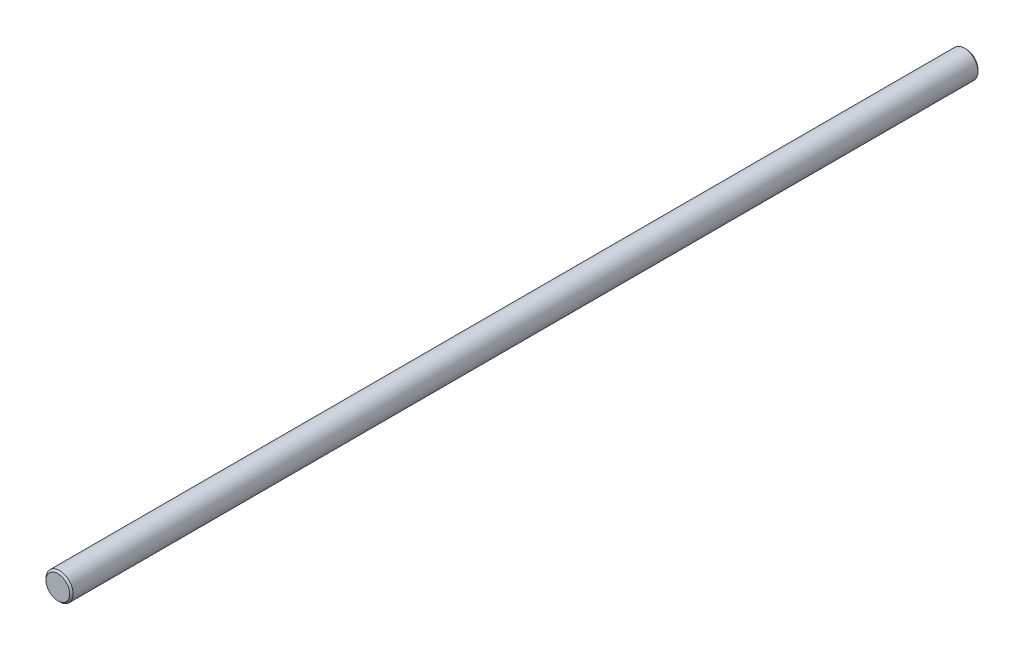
ISO-10303-21;
HEADER;
FILE_DESCRIPTION(('STEP AP214'),'2;1');
FILE_NAME('part.step','',(''),(''),'','','');
FILE_SCHEMA(('AUTOMOTIVE_DESIGN { 1 0 10303 214 1 1 1 1 }'));
ENDSEC;
DATA;
#1=APPLICATION_CONTEXT('core data for automotive mechanical design processes');
#2=APPLICATION_PROTOCOL_DEFINITION('international standard','automotive_design',2000,#1);
#3=PRODUCT_CONTEXT('',#1,'mechanical');
#4=PRODUCT('Part','Part','',(#3));
#5=PRODUCT_RELATED_PRODUCT_CATEGORY('part','',(#4));
#6=PRODUCT_DEFINITION_FORMATION('','',#4);
#7=PRODUCT_DEFINITION_CONTEXT('part definition',#1,'design');
#8=PRODUCT_DEFINITION('design','',#6,#7);
#9=PRODUCT_DEFINITION_SHAPE('','',#8);
#10=(LENGTH_UNIT() NAMED_UNIT(*) SI_UNIT(.MILLI.,.METRE.));
#11=(NAMED_UNIT(*) PLANE_ANGLE_UNIT() SI_UNIT($,.RADIAN.));
#12=(NAMED_UNIT(*) SI_UNIT($,.STERADIAN.) SOLID_ANGLE_UNIT());
#13=UNCERTAINTY_MEASURE_WITH_UNIT(LENGTH_MEASURE(1.E-05),#10,'distance_accuracy_value','');
#14=(GEOMETRIC_REPRESENTATION_CONTEXT(3) GLOBAL_UNCERTAINTY_ASSIGNED_CONTEXT((#13)) GLOBAL_UNIT_ASSIGNED_CONTEXT((#10,
#11,#12)) REPRESENTATION_CONTEXT('',''));
#15=CARTESIAN_POINT('',(0.,0.,0.));
#16=DIRECTION('',(0.,0.,1.));
#17=DIRECTION('',(1.,0.,0.));
#18=AXIS2_PLACEMENT_3D('',#15,#16,#17);
#19=CARTESIAN_POINT('',(0.,0.,1.));
#20=DIRECTION('',(0.,0.,-1.));
#21=DIRECTION('',(-1.,0.,0.));
#22=AXIS2_PLACEMENT_3D('',#19,#20,#21);
#23=CYLINDRICAL_SURFACE('',#22,4.);
#24=CARTESIAN_POINT('',(0.,0.,0.500000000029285));
#25=DIRECTION('',(0.,0.,1.));
#26=DIRECTION('',(1.,0.,0.));
#27=AXIS2_PLACEMENT_3D('',#24,#25,#26);
#28=CIRCLE('',#27,4.);
#29=CARTESIAN_POINT('',(4.,0.,0.500000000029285));
#30=VERTEX_POINT('',#29);
#31=EDGE_CURVE('E42',#30,#30,#28,.F.);
#32=ORIENTED_EDGE('',*,*,#31,.T.);
#33=EDGE_LOOP('',(#32));
#34=FACE_BOUND('',#33,.T.);
#35=CARTESIAN_POINT('',(0.,0.,-266.500000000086));
#36=DIRECTION('',(0.,0.,1.));
#37=DIRECTION('',(1.,0.,0.));
#38=AXIS2_PLACEMENT_3D('',#35,#36,#37);
#39=CIRCLE('',#38,4.);
#40=CARTESIAN_POINT('',(4.,0.,-266.500000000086));
#41=VERTEX_POINT('',#40);
#42=EDGE_CURVE('E46',#41,#41,#39,.T.);
#43=ORIENTED_EDGE('',*,*,#42,.T.);
#44=EDGE_LOOP('',(#43));
#45=FACE_BOUND('',#44,.T.);
#46=ADVANCED_FACE('F31',(#34,#45),#23,.T.);
#47=CARTESIAN_POINT('',(0.,0.,1.));
#48=DIRECTION('',(0.,0.,1.));
#49=DIRECTION('',(1.,0.,0.));
#50=AXIS2_PLACEMENT_3D('',#47,#48,#49);
#51=PLANE('',#50);
#52=CARTESIAN_POINT('',(0.,0.,1.));
#53=DIRECTION('',(0.,0.,1.));
#54=DIRECTION('',(1.,0.,0.));
#55=AXIS2_PLACEMENT_3D('',#52,#53,#54);
#56=CIRCLE('',#55,3.50000000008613);
#57=CARTESIAN_POINT('',(3.50000000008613,0.,1.));
#58=VERTEX_POINT('',#57);
#59=EDGE_CURVE('E38',#58,#58,#56,.T.);
#60=ORIENTED_EDGE('',*,*,#59,.T.);
#61=EDGE_LOOP('',(#60));
#62=FACE_BOUND('',#61,.T.);
#63=ADVANCED_FACE('F62',(#62),#51,.T.);
#64=CARTESIAN_POINT('',(0.,0.,-267.));
#65=DIRECTION('',(0.,0.,1.));
#66=DIRECTION('',(1.,0.,0.));
#67=AXIS2_PLACEMENT_3D('',#64,#65,#66);
#68=PLANE('',#67);
#69=CARTESIAN_POINT('',(0.,0.,-267.));
#70=DIRECTION('',(0.,0.,1.));
#71=DIRECTION('',(1.,0.,0.));
#72=AXIS2_PLACEMENT_3D('',#69,#70,#71);
#73=CIRCLE('',#72,3.50000000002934);
#74=CARTESIAN_POINT('',(3.50000000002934,0.,-267.));
#75=VERTEX_POINT('',#74);
#76=EDGE_CURVE('E10',#75,#75,#73,.F.);
#77=ORIENTED_EDGE('',*,*,#76,.T.);
#78=EDGE_LOOP('',(#77));
#79=FACE_BOUND('',#78,.T.);
#80=ADVANCED_FACE('F59',(#79),#68,.F.);
#81=CARTESIAN_POINT('',(0.,0.,0.500000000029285));
#82=DIRECTION('',(0.,0.,-1.));
#83=DIRECTION('',(-1.,0.,0.));
#84=AXIS2_PLACEMENT_3D('',#81,#82,#83);
#85=CONICAL_SURFACE('',#84,4.,0.785398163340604);
#86=ORIENTED_EDGE('',*,*,#59,.F.);
#87=EDGE_LOOP('',(#86));
#88=FACE_BOUND('',#87,.T.);
#89=ORIENTED_EDGE('',*,*,#31,.F.);
#90=EDGE_LOOP('',(#89));
#91=FACE_BOUND('',#90,.T.);
#92=ADVANCED_FACE('F55',(#88,#91),#85,.T.);
#93=CARTESIAN_POINT('',(0.,0.,-267.));
#94=DIRECTION('',(0.,0.,1.));
#95=DIRECTION('',(1.,0.,0.));
#96=AXIS2_PLACEMENT_3D('',#93,#94,#95);
#97=CONICAL_SURFACE('',#96,3.50000000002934,0.785398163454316);
#98=ORIENTED_EDGE('',*,*,#42,.F.);
#99=EDGE_LOOP('',(#98));
#100=FACE_BOUND('',#99,.T.);
#101=ORIENTED_EDGE('',*,*,#76,.F.);
#102=EDGE_LOOP('',(#101));
#103=FACE_BOUND('',#102,.T.);
#104=ADVANCED_FACE('F33',(#100,#103),#97,.T.);
#105=CLOSED_SHELL('',(#46,#63,#80,#92,#104));
#106=MANIFOLD_SOLID_BREP('B2',#105);
#107=ADVANCED_BREP_SHAPE_REPRESENTATION('',(#18,#106),#14);
#108=SHAPE_DEFINITION_REPRESENTATION(#9,#107);
ENDSEC;
END-ISO-10303-21;
